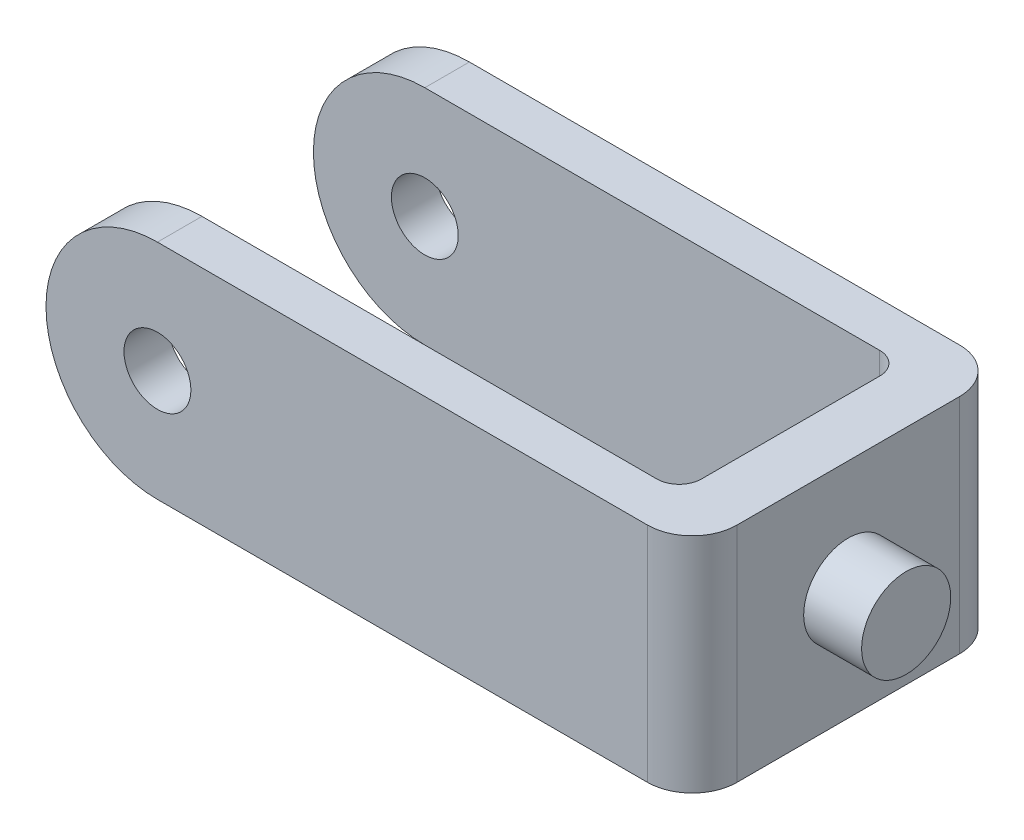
from build123d import *

# Parameters (mm, degrees)
SALIENTE_EXTRUIR1_DEPTH = 50
REDONDEO1_R             = 10
CROQUIS2_R              = 25
SALIENTE_EXTRUIR2_DEPTH = 10
CROQUIS3_R              = 25
SALIENTE_EXTRUIR3_DEPTH = 10
CROQUIS4_R              = 7.5
CORTAR_EXTRUIR1_DEPTH   = 115.033665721
CROQUIS5_R              = 10
SALIENTE_EXTRUIR4_DEPTH = 13
REDONDEO2_R             = 5


with BuildPart() as part:
    # Croquis1 → Saliente-Extruir1 (new body)
    with BuildSketch(Plane(origin=(0, 0, 0), x_dir=(1, 0, 0), z_dir=(0, 1, 0))):
        Polygon((-45.142288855, 40), (74.857711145, 40), (74.857711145, -30), (-45.142288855, -30), (-45.142288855, -20), (61.924765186, -20), (61.924765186, 30), (-45.142288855, 30), align=None)
    extrude(amount=SALIENTE_EXTRUIR1_DEPTH)

    # Redondeo1
    redondeo1_edges = [part.edges().sort_by_distance(p)[0] for p in [
        (74.857711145, 25, -40),
        (74.857711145, 25, 30),
    ]]
    fillet(redondeo1_edges, radius=REDONDEO1_R)

    # Croquis2 → Saliente-Extruir2 (add)
    with BuildSketch(Plane(origin=(0, 0, -40), x_dir=(-1, 0, 0), z_dir=(0, 0, -1))):
        with Locations((45.142288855, 25)):
            Circle(CROQUIS2_R)
    extrude(amount=-SALIENTE_EXTRUIR2_DEPTH)

    # Croquis3 → Saliente-Extruir3 (add)
    with BuildSketch(Plane(origin=(0, 0, 20), x_dir=(-1, 0, 0), z_dir=(0, 0, -1))):
        with Locations((45.142288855, 25)):
            Circle(CROQUIS3_R)
    extrude(amount=-SALIENTE_EXTRUIR3_DEPTH)

    # Croquis4 → Cortar-Extruir1 (cut, through all)
    with BuildSketch(Plane(origin=(0, 0, -40), x_dir=(-1, 0, 0), z_dir=(0, 0, -1))):
        with Locations((45.142288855, 25)):
            Circle(CROQUIS4_R)
    extrude(amount=-CORTAR_EXTRUIR1_DEPTH, mode=Mode.SUBTRACT)

    # Croquis5 → Saliente-Extruir4 (add)
    with BuildSketch(Plane(origin=(74.857711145, 0, 0), x_dir=(0, 0, -1), z_dir=(1, 0, 0))):
        with Locations(Location((5, 25, 0), (0, 0, 180))):
            Circle(CROQUIS5_R)
    extrude(amount=SALIENTE_EXTRUIR4_DEPTH)

    # Redondeo2
    redondeo2_edges = [part.edges().sort_by_distance(p)[0] for p in [
        (61.924765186, 25, 20),
        (61.924765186, 25, -30),
    ]]
    fillet(redondeo2_edges, radius=REDONDEO2_R)


solid = part.part
